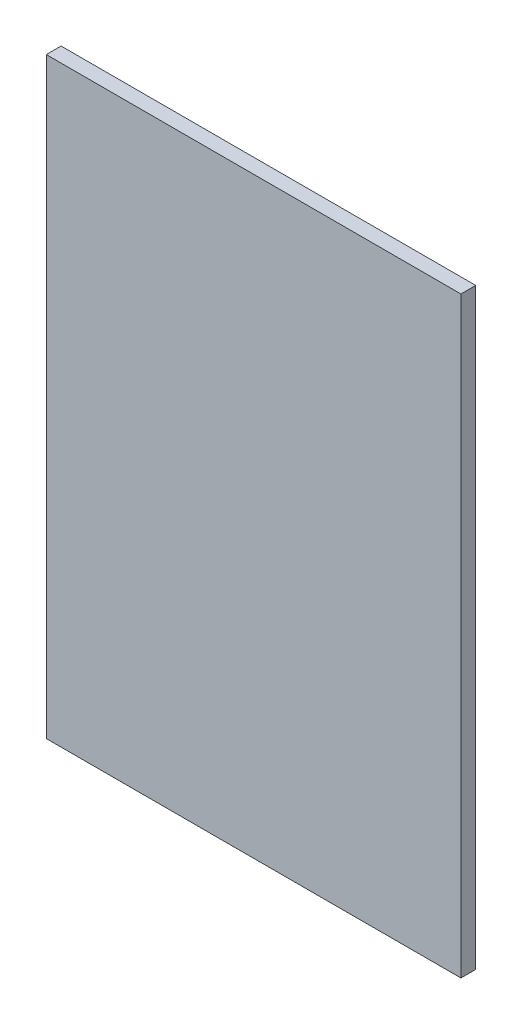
from build123d import *

# Parameters (mm, degrees)
SKETCH1_W            = 254
SKETCH1_H            = 6.35
PANEL_OR_BLOCK_DEPTH = 177.8


with BuildPart() as part:
    # Sketch1 → Panel_or_block (new body)
    with BuildSketch(Plane.YZ):
        with Locations((0, -3.175)):
            Rectangle(SKETCH1_W, SKETCH1_H)
    extrude(amount=PANEL_OR_BLOCK_DEPTH)


solid = part.part
